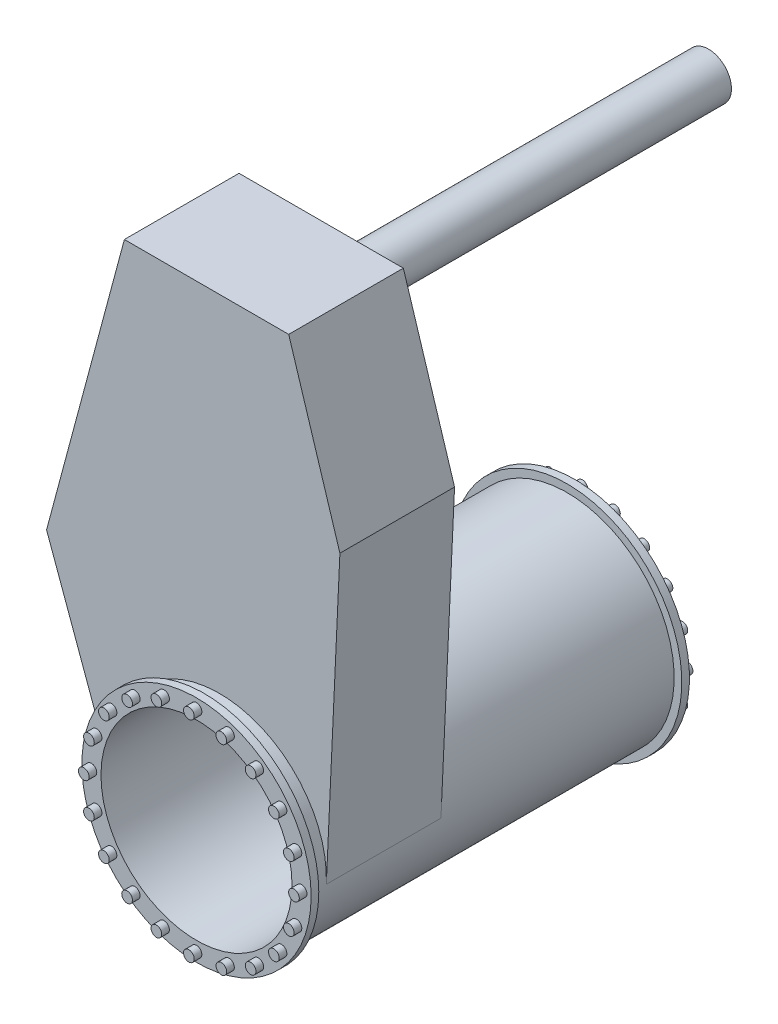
from build123d import *
from build123d.topology import SkipClean

# Parameters (mm, degrees)
SKETCH1_R           = 150
SKETCH1_R_2         = 125
BOSS_EXTRUDE1_DEPTH = 10
SKETCH2_R           = 7
BOSS_EXTRUDE2_DEPTH = 10
CIRPATTERN1_COUNT   = 20
BOSS_EXTRUDE3_START = 20
SKETCH5_R           = 140
SKETCH5_R_2         = 125
BOSS_EXTRUDE3_DEPTH = 20
BOSS_EXTRUDE4_START = 150
SKETCH6_R           = 125
BOSS_EXTRUDE4_DEPTH = 150
BOSS_EXTRUDE5_START = 305
SKETCH7_R           = 140
SKETCH7_R_2         = 125
BOSS_EXTRUDE5_DEPTH = 305
BOSS_EXTRUDE6_START = 10
SKETCH8_R           = 150
SKETCH8_R_2         = 125
BOSS_EXTRUDE6_DEPTH = 10
BOSS_EXTRUDE7_START = 10
SKETCH9_R           = 7
BOSS_EXTRUDE7_DEPTH = 10
CIRPATTERN2_COUNT   = 20
SKETCH10_R          = 30
CUT_EXTRUDE1_DEPTH  = 20
BOSS_EXTRUDE8_START = 510
SKETCH12_R          = 30
BOSS_EXTRUDE8_DEPTH = 510


with BuildPart() as part:
    # Sketch1 → Boss-Extrude1 (new body)
    with BuildSketch(Plane.XY):
        Circle(SKETCH1_R)
        Circle(SKETCH1_R_2, mode=Mode.SUBTRACT)
    extrude(amount=BOSS_EXTRUDE1_DEPTH)

    # Sketch2 → Boss-Extrude2 (add)
    with BuildSketch(Plane.XY.offset(10)):
        with Locations((0, 137.5)):
            Circle(SKETCH2_R)
    boss_extrude2 = extrude(amount=BOSS_EXTRUDE2_DEPTH)

    # CirPattern1: Boss-Extrude2 ×20 about axis
    cirpattern1_axis = Axis((0, 0, 0), (0, 0, 1))
    for i in range(1, CIRPATTERN1_COUNT):
        add(boss_extrude2.rotate(cirpattern1_axis, i * 360 / CIRPATTERN1_COUNT))

    # Sketch5 → Boss-Extrude3 (add)
    with SkipClean():  # the faces are left unmerged after this step: merging them gives an invalid solid
        with BuildSketch(Plane(origin=(0, 0, 0), x_dir=(-1, 0, 0), z_dir=(0, 0, -1)).offset(BOSS_EXTRUDE3_START)):
            Circle(SKETCH5_R)
            Circle(SKETCH5_R_2, mode=Mode.SUBTRACT)
        extrude(amount=-BOSS_EXTRUDE3_DEPTH)

    # Sketch6 → Boss-Extrude4 (add)
    with SkipClean():  # the faces are left unmerged after this step: merging them gives an invalid solid
        with BuildSketch(Plane(origin=(0, 0, -20), x_dir=(-1, 0, 0), z_dir=(0, 0, -1)).offset(BOSS_EXTRUDE4_START)):
            with BuildLine():
                Line((131.55696691, -47.882820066), (226.189227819, 212.117179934))
                Line((226.189227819, 212.117179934), (124.368534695, 592.117179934))
                Line((124.368534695, 592.117179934), (-90.631465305, 592.117179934))
                Line((-90.631465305, 592.117179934), (-157.641149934, 377.605695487))
                Line((-157.641149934, 377.605695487), (-139.850047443, -6.477980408))
                ThreePointArc((-139.850047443, -6.477980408), (-21.113597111, -138.398757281), (131.55696691, -47.882820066))
            make_face()
            Circle(SKETCH6_R, mode=Mode.SUBTRACT)
        extrude(amount=-BOSS_EXTRUDE4_DEPTH)

    # Sketch7 → Boss-Extrude5 (add)
    with SkipClean():  # the faces are left unmerged after this step: merging them gives an invalid solid
        with BuildSketch(Plane(origin=(0, 0, -170), x_dir=(-1, 0, 0), z_dir=(0, 0, -1)).offset(BOSS_EXTRUDE5_START)):
            Circle(SKETCH7_R)
            Circle(SKETCH7_R_2, mode=Mode.SUBTRACT)
        extrude(amount=-BOSS_EXTRUDE5_DEPTH)

    # Sketch8 → Boss-Extrude6 (add)
    with SkipClean():  # the faces are left unmerged after this step: merging them gives an invalid solid
        with BuildSketch(Plane(origin=(0, 0, -475), x_dir=(-1, 0, 0), z_dir=(0, 0, -1)).offset(BOSS_EXTRUDE6_START)):
            with Locations(Location((0, 0, 0), (0, 0, 180))):
                Circle(SKETCH8_R)
            Circle(SKETCH8_R_2, mode=Mode.SUBTRACT)
        extrude(amount=-BOSS_EXTRUDE6_DEPTH)

    # Sketch9 → Boss-Extrude7 (add)
    with SkipClean():  # the faces are left unmerged after this step: merging them gives an invalid solid
        with BuildSketch(Plane(origin=(0, 0, -485), x_dir=(-1, 0, 0), z_dir=(0, 0, -1)).offset(BOSS_EXTRUDE7_START)):
            with Locations(Location((0, 137.5, 0), (0, 0, 180))):
                Circle(SKETCH9_R)
        boss_extrude7 = extrude(amount=-BOSS_EXTRUDE7_DEPTH)

    # CirPattern2: Boss-Extrude7 ×20 about axis
    with SkipClean():  # the faces are left unmerged after this step: merging them gives an invalid solid
        cirpattern2_axis = Axis((0, 0, 0), (0, 0, 1))
        for i in range(1, CIRPATTERN2_COUNT):
            add(boss_extrude7.rotate(cirpattern2_axis, i * 360 / CIRPATTERN2_COUNT))

    # Sketch10 → Cut-Extrude1 (cut)
    with SkipClean():  # the faces are left unmerged after this step: merging them gives an invalid solid
        with BuildSketch(Plane(origin=(0, 0, -170), x_dir=(-1, 0, 0), z_dir=(0, 0, -1))):
            with Locations((0, 520)):
                Circle(SKETCH10_R)
        extrude(amount=-CUT_EXTRUDE1_DEPTH, mode=Mode.SUBTRACT)

    # Sketch12 → Boss-Extrude8 (add)
    with SkipClean():  # the faces are left unmerged after this step: merging them gives an invalid solid
        with BuildSketch(Plane(origin=(0, 0, -150), x_dir=(-1, 0, 0), z_dir=(0, 0, -1)).offset(BOSS_EXTRUDE8_START)):
            with Locations((0, 520)):
                Circle(SKETCH12_R)
        extrude(amount=-BOSS_EXTRUDE8_DEPTH)


solid = part.part
